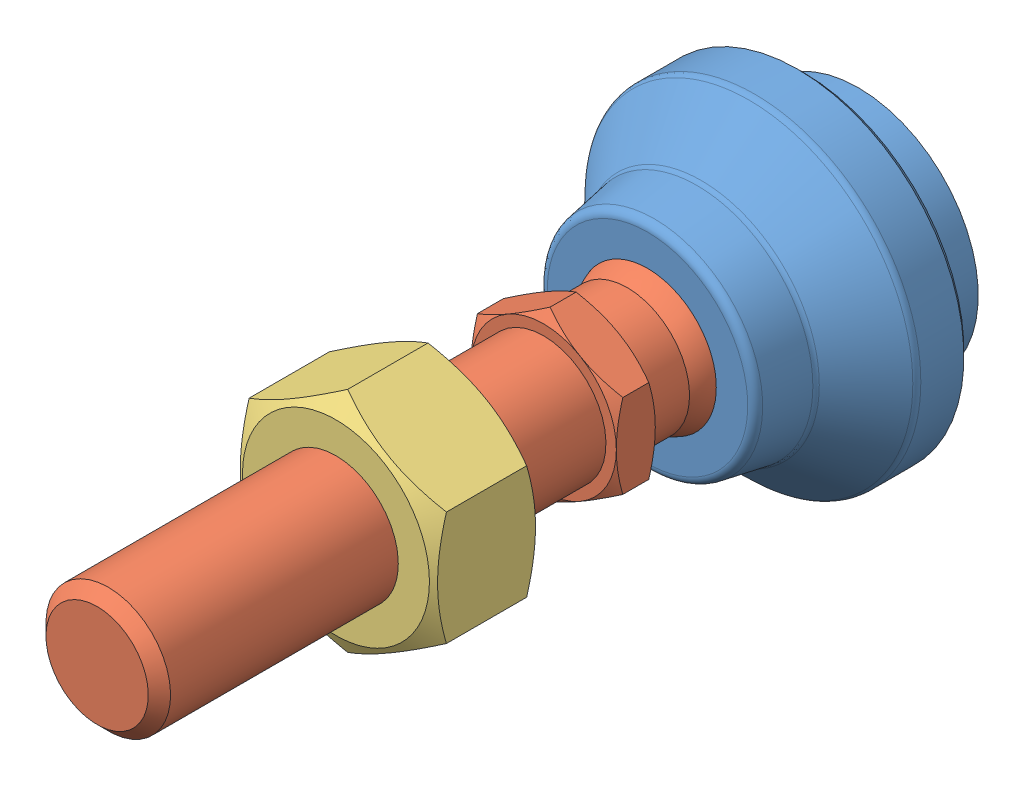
SolidWorks assembly LSVA32-M12X43-SUS.sldasm, configuration Default (file format 15000). Lengths in mm.
Overall size (32 32 73.3).
3 component instances, 3 part files, 0 mates.
Components (placement in the parent):
- LSVA32-M12X43-SUS_01-1: LSVA32-M12X43-SUS_01.SLDPRT [Default] at (0 0 5.3) x (1 0 0) z (0 -1 0) size (32 20.3 32)
- LSVA32-M12X43-SUS_02-1: LSVA32-M12X43-SUS_02.sldprt [Default] at (0 0 18.05) x (1 0 0) z (0 -1 0) size (14 62.25 16.17)
- LSVA32-M12X43-SUS_03-1: LSVA32-M12X43-SUS_03.sldprt [Default] at (0 0 40.3) size (19 21.94 10)
